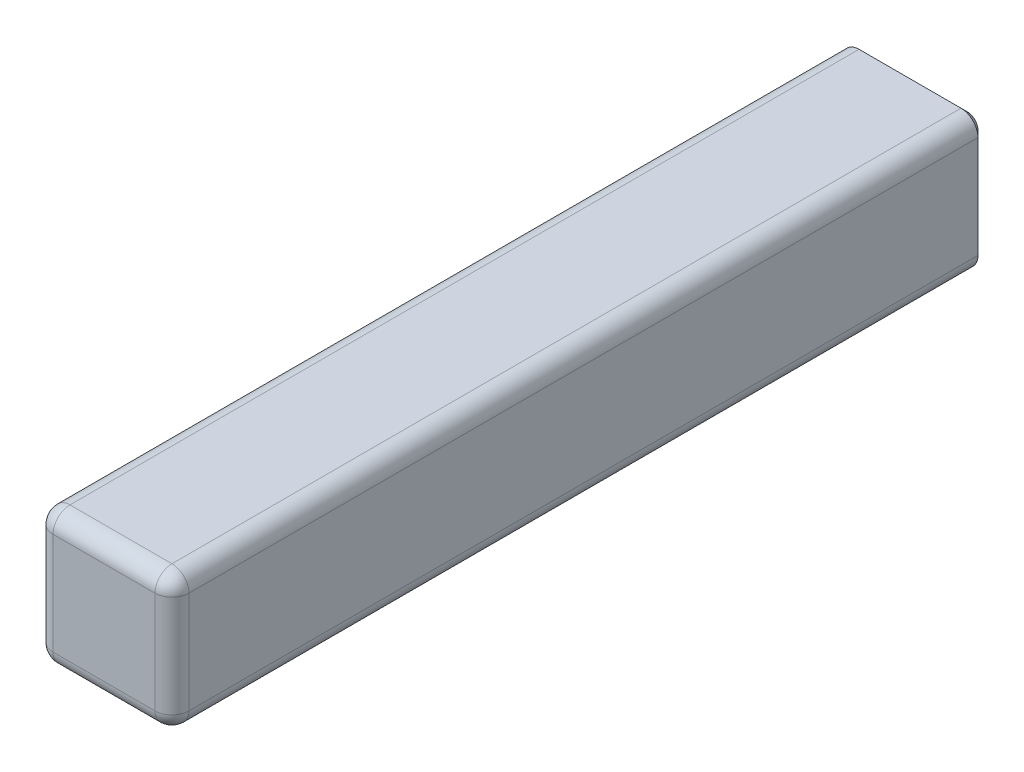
from build123d import *

# Parameters (mm, degrees)
BOSS_EXTRUDE1_DEPTH     = 1366.667
BOSS_EXTRUDE2_START     = -25.4
BOSS_EXTRUDE2_DEPTH     = 25.4
FILLET1_R               = 25.4
CUT_EXTRUDE1_DEPTH      = 1375.199333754
CUT_EXTRUDE1_DEPTH_BACK = 1375.199333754
SKETCH2_W               = 539.472979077
SKETCH2_H               = 369.560229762
CHAMFER1_SIZE           = 9.525


with BuildPart() as part:
    # 8in beam → Boss-Extrude1 (new body)
    with BuildSketch(Plane(origin=(0, 0, 0), x_dir=(0, 1, 0), z_dir=(0, 0, 1))):
        with BuildLine():
            Line((-76.2, -101.6), (76.2, -101.6))
            ThreePointArc((76.2, -101.6), (94.160512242, -94.160512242), (101.6, -76.2))
            Line((101.6, -76.2), (101.6, 76.2))
            ThreePointArc((101.6, 76.2), (94.160512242, 94.160512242), (76.2, 101.6))
            Line((76.2, 101.6), (-76.2, 101.6))
            ThreePointArc((-76.2, 101.6), (-94.160512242, 94.160512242), (-101.6, 76.2))
            Line((-101.6, 76.2), (-101.6, -76.2))
            ThreePointArc((-101.6, -76.2), (-94.160512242, -94.160512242), (-76.2, -101.6))
        make_face()
        with BuildLine():
            Line((-76.2, -88.9), (76.2, -88.9))
            ThreePointArc((76.2, -88.9), (85.180256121, -85.180256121), (88.9, -76.2))
            Line((88.9, -76.2), (88.9, 76.2))
            ThreePointArc((88.9, 76.2), (85.180256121, 85.180256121), (76.2, 88.9))
            Line((76.2, 88.9), (-76.2, 88.9))
            ThreePointArc((-76.2, 88.9), (-85.180256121, 85.180256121), (-88.9, 76.2))
            Line((-88.9, 76.2), (-88.9, -76.2))
            ThreePointArc((-88.9, -76.2), (-85.180256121, -85.180256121), (-76.2, -88.9))
        make_face(mode=Mode.SUBTRACT)
    extrude(amount=BOSS_EXTRUDE1_DEPTH)

    # Sketch1 → Boss-Extrude2 (add)
    with BuildSketch(Plane.XY.offset(1366.667).offset(BOSS_EXTRUDE2_START)):
        with BuildLine():
            Line((-76.2, 88.9), (76.2, 88.9))
            ThreePointArc((76.2, 88.9), (85.180256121, 85.180256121), (88.9, 76.2))
            Line((88.9, 76.2), (88.9, -76.2))
            ThreePointArc((88.9, -76.2), (85.180256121, -85.180256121), (76.2, -88.9))
            Line((76.2, -88.9), (-76.2, -88.9))
            ThreePointArc((-76.2, -88.9), (-85.180256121, -85.180256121), (-88.9, -76.2))
            Line((-88.9, -76.2), (-88.9, 76.2))
            ThreePointArc((-88.9, 76.2), (-85.180256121, 85.180256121), (-76.2, 88.9))
        make_face()
    extrude(amount=BOSS_EXTRUDE2_DEPTH)

    # Fillet1
    fillet1_edges = [part.edges().sort_by_distance(p)[0] for p in [
        (-94.160512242, -94.160512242, 1366.667),
        (0, -101.6, 1366.667),
        (94.160512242, -94.160512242, 1366.667),
        (101.6, 0, 1366.667),
        (94.160512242, 94.160512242, 1366.667),
        (0, 101.6, 1366.667),
        (-94.160512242, 94.160512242, 1366.667),
        (-101.6, 0, 1366.667),
    ]]
    fillet(fillet1_edges, radius=FILLET1_R)

    # Sketch2 → Cut-Extrude1 (cut, two sides: drawn at the far end of the back side and taken through both)
    with BuildSketch(Plane(origin=(0, 0, 0), x_dir=(-1, 0, 0), z_dir=(0, 1, 0)).offset(-CUT_EXTRUDE1_DEPTH_BACK)):
        with Locations((11.681501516, -32.380114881)):
            Rectangle(SKETCH2_W, SKETCH2_H)
    extrude(amount=CUT_EXTRUDE1_DEPTH + CUT_EXTRUDE1_DEPTH_BACK, mode=Mode.SUBTRACT)

    # Chamfer1
    chamfer1_edges = [part.edges().sort_by_distance(p)[0] for p in [
        (0, 101.6, 152.4),
        (-94.160512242, 94.160512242, 152.4),
        (-101.6, 0, 152.4),
        (-94.160512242, -94.160512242, 152.4),
        (0, -101.6, 152.4),
        (94.160512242, -94.160512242, 152.4),
        (101.6, 0, 152.4),
        (94.160512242, 94.160512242, 152.4),
    ]]
    chamfer(chamfer1_edges, length=CHAMFER1_SIZE)


solid = part.part
